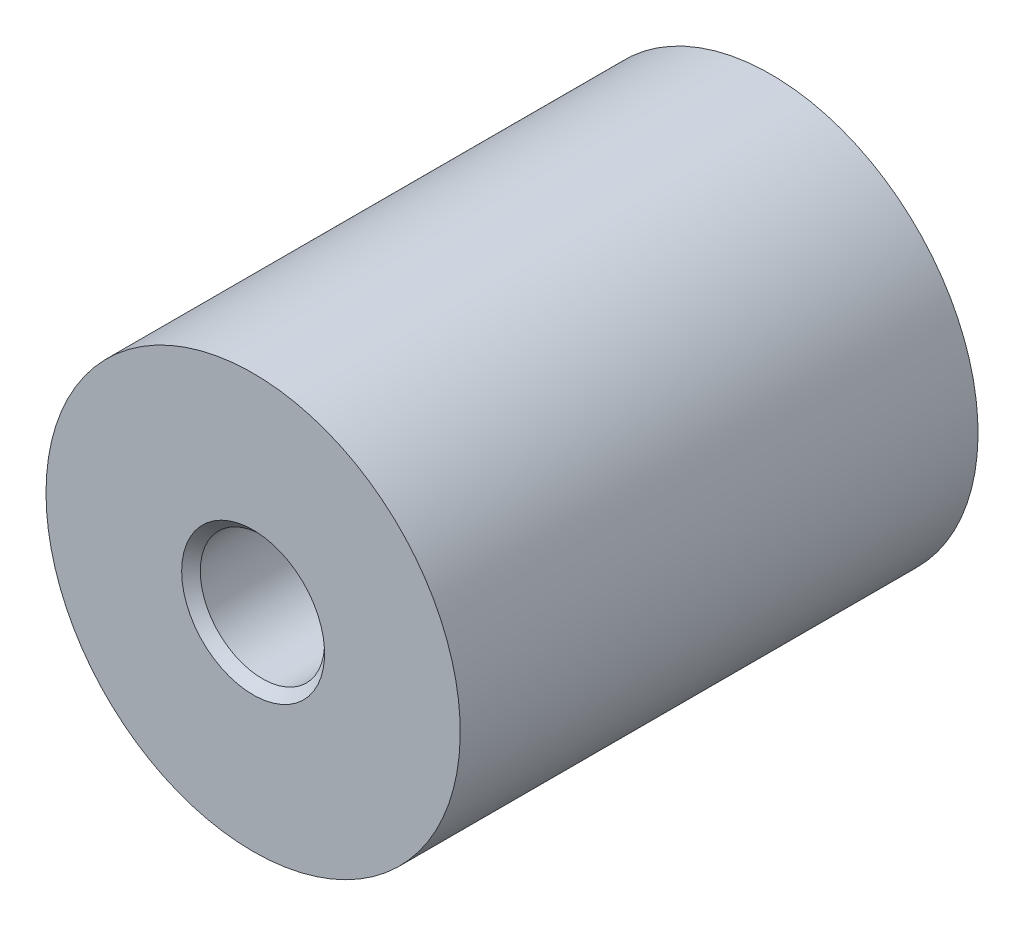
ISO-10303-21;
HEADER;
FILE_DESCRIPTION(('STEP AP214'),'2;1');
FILE_NAME('part.step','',(''),(''),'','','');
FILE_SCHEMA(('AUTOMOTIVE_DESIGN { 1 0 10303 214 1 1 1 1 }'));
ENDSEC;
DATA;
#1=APPLICATION_CONTEXT('core data for automotive mechanical design processes');
#2=APPLICATION_PROTOCOL_DEFINITION('international standard','automotive_design',2000,#1);
#3=PRODUCT_CONTEXT('',#1,'mechanical');
#4=PRODUCT('Part','Part','',(#3));
#5=PRODUCT_RELATED_PRODUCT_CATEGORY('part','',(#4));
#6=PRODUCT_DEFINITION_FORMATION('','',#4);
#7=PRODUCT_DEFINITION_CONTEXT('part definition',#1,'design');
#8=PRODUCT_DEFINITION('design','',#6,#7);
#9=PRODUCT_DEFINITION_SHAPE('','',#8);
#10=(LENGTH_UNIT() NAMED_UNIT(*) SI_UNIT(.MILLI.,.METRE.));
#11=(NAMED_UNIT(*) PLANE_ANGLE_UNIT() SI_UNIT($,.RADIAN.));
#12=(NAMED_UNIT(*) SI_UNIT($,.STERADIAN.) SOLID_ANGLE_UNIT());
#13=UNCERTAINTY_MEASURE_WITH_UNIT(LENGTH_MEASURE(1.E-05),#10,'distance_accuracy_value','');
#14=(GEOMETRIC_REPRESENTATION_CONTEXT(3) GLOBAL_UNCERTAINTY_ASSIGNED_CONTEXT((#13)) GLOBAL_UNIT_ASSIGNED_CONTEXT((#10,
#11,#12)) REPRESENTATION_CONTEXT('',''));
#15=CARTESIAN_POINT('',(0.,0.,0.));
#16=DIRECTION('',(0.,0.,1.));
#17=DIRECTION('',(1.,0.,0.));
#18=AXIS2_PLACEMENT_3D('',#15,#16,#17);
#19=CARTESIAN_POINT('',(0.,0.,0.5));
#20=DIRECTION('',(0.,0.,1.));
#21=DIRECTION('',(0.,-1.,0.));
#22=AXIS2_PLACEMENT_3D('',#19,#20,#21);
#23=CYLINDRICAL_SURFACE('',#22,10.);
#24=CARTESIAN_POINT('',(0.,0.,0.));
#25=DIRECTION('',(0.,0.,1.));
#26=DIRECTION('',(0.,-1.,0.));
#27=AXIS2_PLACEMENT_3D('',#24,#25,#26);
#28=CIRCLE('',#27,10.);
#29=CARTESIAN_POINT('',(0.,-10.,0.));
#30=VERTEX_POINT('',#29);
#31=EDGE_CURVE('E23',#30,#30,#28,.T.);
#32=ORIENTED_EDGE('',*,*,#31,.T.);
#33=EDGE_LOOP('',(#32));
#34=FACE_BOUND('',#33,.T.);
#35=CARTESIAN_POINT('',(0.,0.,25.));
#36=DIRECTION('',(0.,0.,-1.));
#37=DIRECTION('',(-1.,0.,0.));
#38=AXIS2_PLACEMENT_3D('',#35,#36,#37);
#39=CIRCLE('',#38,10.);
#40=CARTESIAN_POINT('',(-10.,0.,25.));
#41=VERTEX_POINT('',#40);
#42=EDGE_CURVE('E32',#41,#41,#39,.T.);
#43=ORIENTED_EDGE('',*,*,#42,.T.);
#44=EDGE_LOOP('',(#43));
#45=FACE_BOUND('',#44,.T.);
#46=ADVANCED_FACE('F12',(#34,#45),#23,.T.);
#47=CARTESIAN_POINT('',(10.,0.,0.));
#48=DIRECTION('',(0.,0.,-1.));
#49=DIRECTION('',(0.,1.,0.));
#50=AXIS2_PLACEMENT_3D('',#47,#48,#49);
#51=PLANE('',#50);
#52=CARTESIAN_POINT('',(0.,0.,0.));
#53=DIRECTION('',(0.,0.,-1.));
#54=DIRECTION('',(0.,1.,0.));
#55=AXIS2_PLACEMENT_3D('',#52,#53,#54);
#56=CIRCLE('',#55,3.45);
#57=CARTESIAN_POINT('',(0.,3.45,0.));
#58=VERTEX_POINT('',#57);
#59=EDGE_CURVE('E8',#58,#58,#56,.F.);
#60=ORIENTED_EDGE('',*,*,#59,.T.);
#61=EDGE_LOOP('',(#60));
#62=FACE_BOUND('',#61,.T.);
#63=ORIENTED_EDGE('',*,*,#31,.F.);
#64=EDGE_LOOP('',(#63));
#65=FACE_BOUND('',#64,.T.);
#66=ADVANCED_FACE('F58',(#62,#65),#51,.T.);
#67=CARTESIAN_POINT('',(0.,0.,0.));
#68=DIRECTION('',(0.,0.,1.));
#69=DIRECTION('',(0.,-1.,0.));
#70=AXIS2_PLACEMENT_3D('',#67,#68,#69);
#71=CYLINDRICAL_SURFACE('',#70,3.);
#72=CARTESIAN_POINT('',(0.,0.,0.45));
#73=DIRECTION('',(0.,0.,-1.));
#74=DIRECTION('',(0.,1.,0.));
#75=AXIS2_PLACEMENT_3D('',#72,#73,#74);
#76=CIRCLE('',#75,3.);
#77=CARTESIAN_POINT('',(0.,3.,0.45));
#78=VERTEX_POINT('',#77);
#79=EDGE_CURVE('E19',#78,#78,#76,.T.);
#80=ORIENTED_EDGE('',*,*,#79,.T.);
#81=EDGE_LOOP('',(#80));
#82=FACE_BOUND('',#81,.T.);
#83=CARTESIAN_POINT('',(0.,0.,6.));
#84=DIRECTION('',(0.,0.,-1.));
#85=DIRECTION('',(0.,1.,0.));
#86=AXIS2_PLACEMENT_3D('',#83,#84,#85);
#87=CIRCLE('',#86,3.);
#88=CARTESIAN_POINT('',(0.,3.,6.));
#89=VERTEX_POINT('',#88);
#90=EDGE_CURVE('E27',#89,#89,#87,.T.);
#91=ORIENTED_EDGE('',*,*,#90,.F.);
#92=EDGE_LOOP('',(#91));
#93=FACE_BOUND('',#92,.T.);
#94=ADVANCED_FACE('F63',(#82,#93),#71,.F.);
#95=CARTESIAN_POINT('',(0.,0.,6.));
#96=DIRECTION('',(0.,0.,-1.));
#97=DIRECTION('',(0.,1.,0.));
#98=AXIS2_PLACEMENT_3D('',#95,#96,#97);
#99=PLANE('',#98);
#100=ORIENTED_EDGE('',*,*,#90,.T.);
#101=EDGE_LOOP('',(#100));
#102=FACE_BOUND('',#101,.T.);
#103=ADVANCED_FACE('F69',(#102),#99,.T.);
#104=CARTESIAN_POINT('',(0.,0.,0.45));
#105=DIRECTION('',(0.,0.,-1.));
#106=DIRECTION('',(0.,1.,0.));
#107=AXIS2_PLACEMENT_3D('',#104,#105,#106);
#108=CONICAL_SURFACE('',#107,3.,0.785398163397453);
#109=ORIENTED_EDGE('',*,*,#59,.F.);
#110=EDGE_LOOP('',(#109));
#111=FACE_BOUND('',#110,.T.);
#112=ORIENTED_EDGE('',*,*,#79,.F.);
#113=EDGE_LOOP('',(#112));
#114=FACE_BOUND('',#113,.T.);
#115=ADVANCED_FACE('F14',(#111,#114),#108,.F.);
#116=CARTESIAN_POINT('',(0.,10.,25.));
#117=DIRECTION('',(0.,0.,1.));
#118=DIRECTION('',(1.,0.,0.));
#119=AXIS2_PLACEMENT_3D('',#116,#117,#118);
#120=PLANE('',#119);
#121=CARTESIAN_POINT('',(0.,0.,25.));
#122=DIRECTION('',(0.,0.,-1.));
#123=DIRECTION('',(-1.,0.,0.));
#124=AXIS2_PLACEMENT_3D('',#121,#122,#123);
#125=CIRCLE('',#124,3.45);
#126=CARTESIAN_POINT('',(-3.45,0.,25.));
#127=VERTEX_POINT('',#126);
#128=EDGE_CURVE('E35',#127,#127,#125,.T.);
#129=ORIENTED_EDGE('',*,*,#128,.T.);
#130=EDGE_LOOP('',(#129));
#131=FACE_BOUND('',#130,.T.);
#132=ORIENTED_EDGE('',*,*,#42,.F.);
#133=EDGE_LOOP('',(#132));
#134=FACE_BOUND('',#133,.T.);
#135=ADVANCED_FACE('F73',(#131,#134),#120,.T.);
#136=CARTESIAN_POINT('',(0.,0.,25.));
#137=DIRECTION('',(0.,0.,1.));
#138=DIRECTION('',(1.,0.,0.));
#139=AXIS2_PLACEMENT_3D('',#136,#137,#138);
#140=CONICAL_SURFACE('',#139,3.45,0.785398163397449);
#141=CARTESIAN_POINT('',(0.,0.,24.55));
#142=DIRECTION('',(0.,0.,-1.));
#143=DIRECTION('',(-1.,0.,0.));
#144=AXIS2_PLACEMENT_3D('',#141,#142,#143);
#145=CIRCLE('',#144,3.);
#146=CARTESIAN_POINT('',(-3.,0.,24.55));
#147=VERTEX_POINT('',#146);
#148=EDGE_CURVE('E38',#147,#147,#145,.T.);
#149=ORIENTED_EDGE('',*,*,#148,.T.);
#150=EDGE_LOOP('',(#149));
#151=FACE_BOUND('',#150,.T.);
#152=ORIENTED_EDGE('',*,*,#128,.F.);
#153=EDGE_LOOP('',(#152));
#154=FACE_BOUND('',#153,.T.);
#155=ADVANCED_FACE('F55',(#151,#154),#140,.F.);
#156=CARTESIAN_POINT('',(0.,0.,0.));
#157=DIRECTION('',(0.,0.,-1.));
#158=DIRECTION('',(-1.,0.,0.));
#159=AXIS2_PLACEMENT_3D('',#156,#157,#158);
#160=CYLINDRICAL_SURFACE('',#159,3.);
#161=CARTESIAN_POINT('',(0.,0.,19.));
#162=DIRECTION('',(0.,0.,-1.));
#163=DIRECTION('',(-1.,0.,0.));
#164=AXIS2_PLACEMENT_3D('',#161,#162,#163);
#165=CIRCLE('',#164,3.);
#166=CARTESIAN_POINT('',(-3.,0.,19.));
#167=VERTEX_POINT('',#166);
#168=EDGE_CURVE('E41',#167,#167,#165,.T.);
#169=ORIENTED_EDGE('',*,*,#168,.T.);
#170=EDGE_LOOP('',(#169));
#171=FACE_BOUND('',#170,.T.);
#172=ORIENTED_EDGE('',*,*,#148,.F.);
#173=EDGE_LOOP('',(#172));
#174=FACE_BOUND('',#173,.T.);
#175=ADVANCED_FACE('F45',(#171,#174),#160,.F.);
#176=CARTESIAN_POINT('',(0.,3.,19.));
#177=DIRECTION('',(0.,0.,1.));
#178=DIRECTION('',(1.,0.,0.));
#179=AXIS2_PLACEMENT_3D('',#176,#177,#178);
#180=PLANE('',#179);
#181=ORIENTED_EDGE('',*,*,#168,.F.);
#182=EDGE_LOOP('',(#181));
#183=FACE_BOUND('',#182,.T.);
#184=ADVANCED_FACE('F48',(#183),#180,.T.);
#185=CLOSED_SHELL('',(#46,#66,#94,#103,#115,#135,#155,#175,#184));
#186=MANIFOLD_SOLID_BREP('B1',#185);
#187=ADVANCED_BREP_SHAPE_REPRESENTATION('',(#18,#186),#14);
#188=SHAPE_DEFINITION_REPRESENTATION(#9,#187);
ENDSEC;
END-ISO-10303-21;
